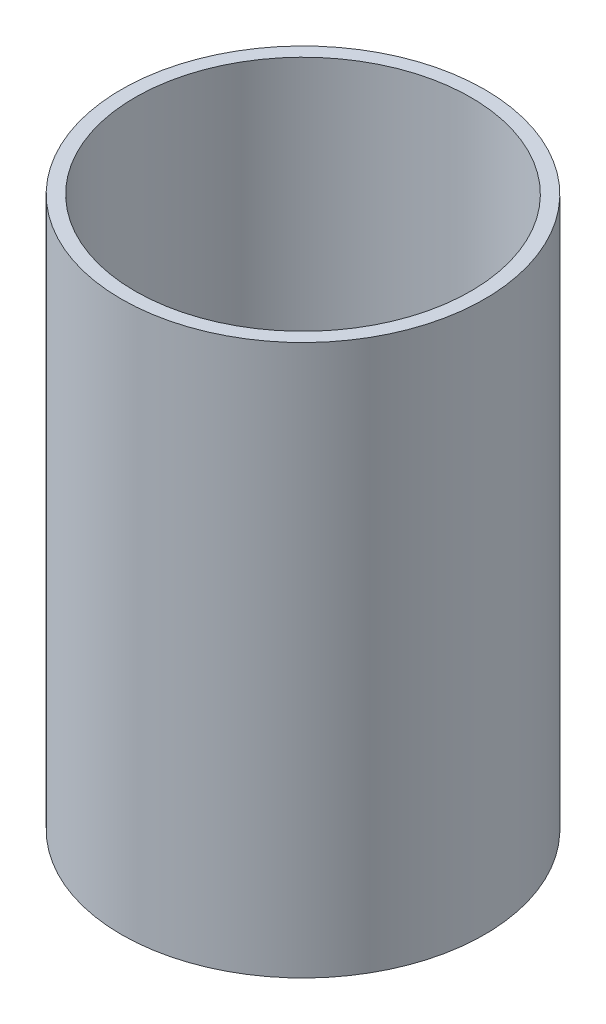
from build123d import *

# Parameters (mm, degrees)
SKETCH1_R           = 33
SKETCH1_R_2         = 30.5
BOSS_EXTRUDE1_DEPTH = 100


with BuildPart() as part:
    # Sketch1 → Boss-Extrude1 (new body)
    with BuildSketch(Plane(origin=(0, 0, 0), x_dir=(1, 0, 0), z_dir=(0, 1, 0))):
        with Locations(Location((0, 0, 0), (0, 0, 270))):
            Circle(SKETCH1_R)
        with Locations(Location((0, 0, 0), (0, 0, 270))):
            Circle(SKETCH1_R_2, mode=Mode.SUBTRACT)
    extrude(amount=BOSS_EXTRUDE1_DEPTH)


solid = part.part
